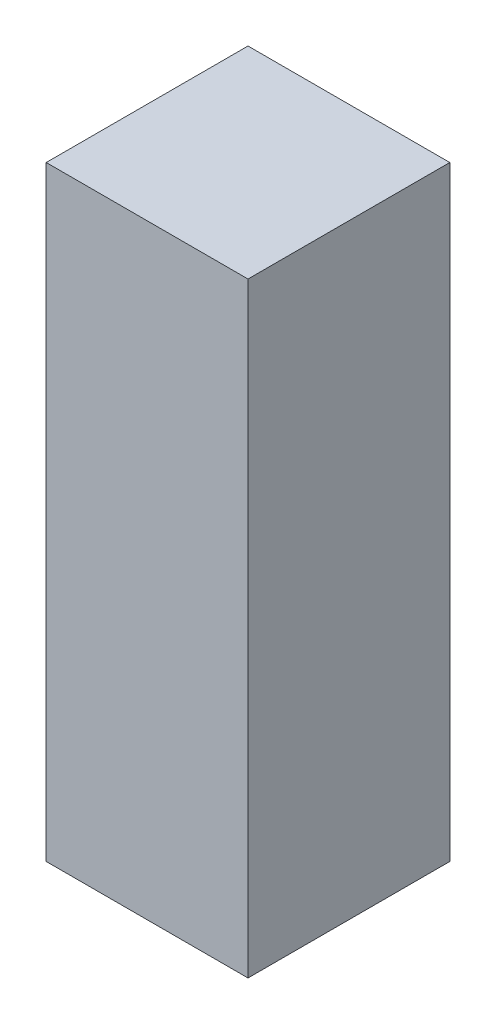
ISO-10303-21;
HEADER;
FILE_DESCRIPTION(('STEP AP214'),'2;1');
FILE_NAME('part.step','',(''),(''),'','','');
FILE_SCHEMA(('AUTOMOTIVE_DESIGN { 1 0 10303 214 1 1 1 1 }'));
ENDSEC;
DATA;
#1=APPLICATION_CONTEXT('core data for automotive mechanical design processes');
#2=APPLICATION_PROTOCOL_DEFINITION('international standard','automotive_design',2000,#1);
#3=PRODUCT_CONTEXT('',#1,'mechanical');
#4=PRODUCT('Part','Part','',(#3));
#5=PRODUCT_RELATED_PRODUCT_CATEGORY('part','',(#4));
#6=PRODUCT_DEFINITION_FORMATION('','',#4);
#7=PRODUCT_DEFINITION_CONTEXT('part definition',#1,'design');
#8=PRODUCT_DEFINITION('design','',#6,#7);
#9=PRODUCT_DEFINITION_SHAPE('','',#8);
#10=(LENGTH_UNIT() NAMED_UNIT(*) SI_UNIT(.MILLI.,.METRE.));
#11=(NAMED_UNIT(*) PLANE_ANGLE_UNIT() SI_UNIT($,.RADIAN.));
#12=(NAMED_UNIT(*) SI_UNIT($,.STERADIAN.) SOLID_ANGLE_UNIT());
#13=UNCERTAINTY_MEASURE_WITH_UNIT(LENGTH_MEASURE(1.E-05),#10,'distance_accuracy_value','');
#14=(GEOMETRIC_REPRESENTATION_CONTEXT(3) GLOBAL_UNCERTAINTY_ASSIGNED_CONTEXT((#13)) GLOBAL_UNIT_ASSIGNED_CONTEXT((#10,
#11,#12)) REPRESENTATION_CONTEXT('',''));
#15=CARTESIAN_POINT('',(0.,0.,0.));
#16=DIRECTION('',(0.,0.,1.));
#17=DIRECTION('',(1.,0.,0.));
#18=AXIS2_PLACEMENT_3D('',#15,#16,#17);
#19=CARTESIAN_POINT('',(0.635000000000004,3.81,0.635000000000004));
#20=DIRECTION('',(-1.,0.,0.));
#21=DIRECTION('',(0.,0.,1.));
#22=AXIS2_PLACEMENT_3D('',#19,#20,#21);
#23=PLANE('',#22);
#24=DIRECTION('',(0.,0.,-1.));
#25=VECTOR('',#24,1.);
#26=CARTESIAN_POINT('',(0.635000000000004,0.,0.635000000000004));
#27=LINE('',#26,#25);
#28=CARTESIAN_POINT('',(0.635000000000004,0.,0.635000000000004));
#29=VERTEX_POINT('',#28);
#30=CARTESIAN_POINT('',(0.635000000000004,0.,-0.634999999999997));
#31=VERTEX_POINT('',#30);
#32=EDGE_CURVE('E96',#29,#31,#27,.T.);
#33=ORIENTED_EDGE('',*,*,#32,.T.);
#34=DIRECTION('',(0.,-1.,0.));
#35=VECTOR('',#34,1.);
#36=CARTESIAN_POINT('',(0.635000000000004,3.81,-0.634999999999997));
#37=LINE('',#36,#35);
#38=CARTESIAN_POINT('',(0.635000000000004,3.81,-0.634999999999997));
#39=VERTEX_POINT('',#38);
#40=EDGE_CURVE('E11',#39,#31,#37,.T.);
#41=ORIENTED_EDGE('',*,*,#40,.F.);
#42=DIRECTION('',(0.,0.,-1.));
#43=VECTOR('',#42,1.);
#44=CARTESIAN_POINT('',(0.635000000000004,3.81,0.635000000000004));
#45=LINE('',#44,#43);
#46=CARTESIAN_POINT('',(0.635000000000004,3.81,0.635000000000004));
#47=VERTEX_POINT('',#46);
#48=EDGE_CURVE('E84',#47,#39,#45,.T.);
#49=ORIENTED_EDGE('',*,*,#48,.F.);
#50=DIRECTION('',(0.,-1.,0.));
#51=VECTOR('',#50,1.);
#52=CARTESIAN_POINT('',(0.635000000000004,3.81,0.635000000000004));
#53=LINE('',#52,#51);
#54=EDGE_CURVE('E92',#47,#29,#53,.T.);
#55=ORIENTED_EDGE('',*,*,#54,.T.);
#56=EDGE_LOOP('',(#33,#41,#49,#55));
#57=FACE_BOUND('',#56,.T.);
#58=ADVANCED_FACE('F33',(#57),#23,.F.);
#59=CARTESIAN_POINT('',(-0.634999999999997,3.81,-0.634999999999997));
#60=DIRECTION('',(0.,0.,1.));
#61=DIRECTION('',(1.,0.,0.));
#62=AXIS2_PLACEMENT_3D('',#59,#60,#61);
#63=PLANE('',#62);
#64=DIRECTION('',(-1.,0.,0.));
#65=VECTOR('',#64,1.);
#66=CARTESIAN_POINT('',(-0.634999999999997,0.,-0.634999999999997));
#67=LINE('',#66,#65);
#68=CARTESIAN_POINT('',(-0.634999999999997,0.,-0.634999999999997));
#69=VERTEX_POINT('',#68);
#70=EDGE_CURVE('E88',#31,#69,#67,.T.);
#71=ORIENTED_EDGE('',*,*,#70,.T.);
#72=DIRECTION('',(0.,-1.,0.));
#73=VECTOR('',#72,1.);
#74=CARTESIAN_POINT('',(-0.634999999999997,3.81,-0.634999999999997));
#75=LINE('',#74,#73);
#76=CARTESIAN_POINT('',(-0.634999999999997,3.81,-0.634999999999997));
#77=VERTEX_POINT('',#76);
#78=EDGE_CURVE('E41',#77,#69,#75,.T.);
#79=ORIENTED_EDGE('',*,*,#78,.F.);
#80=DIRECTION('',(-1.,0.,0.));
#81=VECTOR('',#80,1.);
#82=CARTESIAN_POINT('',(-0.634999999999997,3.81,-0.634999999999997));
#83=LINE('',#82,#81);
#84=EDGE_CURVE('E79',#39,#77,#83,.T.);
#85=ORIENTED_EDGE('',*,*,#84,.F.);
#86=ORIENTED_EDGE('',*,*,#40,.T.);
#87=EDGE_LOOP('',(#71,#79,#85,#86));
#88=FACE_BOUND('',#87,.T.);
#89=ADVANCED_FACE('F87',(#88),#63,.F.);
#90=CARTESIAN_POINT('',(-0.634999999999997,3.81,0.635000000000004));
#91=DIRECTION('',(1.,0.,0.));
#92=DIRECTION('',(0.,0.,-1.));
#93=AXIS2_PLACEMENT_3D('',#90,#91,#92);
#94=PLANE('',#93);
#95=DIRECTION('',(0.,0.,1.));
#96=VECTOR('',#95,1.);
#97=CARTESIAN_POINT('',(-0.634999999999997,0.,0.635000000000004));
#98=LINE('',#97,#96);
#99=CARTESIAN_POINT('',(-0.634999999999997,0.,0.635000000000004));
#100=VERTEX_POINT('',#99);
#101=EDGE_CURVE('E66',#69,#100,#98,.T.);
#102=ORIENTED_EDGE('',*,*,#101,.T.);
#103=DIRECTION('',(0.,-1.,0.));
#104=VECTOR('',#103,1.);
#105=CARTESIAN_POINT('',(-0.634999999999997,3.81,0.635000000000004));
#106=LINE('',#105,#104);
#107=CARTESIAN_POINT('',(-0.634999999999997,3.81,0.635000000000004));
#108=VERTEX_POINT('',#107);
#109=EDGE_CURVE('E89',#108,#100,#106,.T.);
#110=ORIENTED_EDGE('',*,*,#109,.F.);
#111=DIRECTION('',(0.,0.,1.));
#112=VECTOR('',#111,1.);
#113=CARTESIAN_POINT('',(-0.634999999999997,3.81,0.635000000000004));
#114=LINE('',#113,#112);
#115=EDGE_CURVE('E82',#77,#108,#114,.T.);
#116=ORIENTED_EDGE('',*,*,#115,.F.);
#117=ORIENTED_EDGE('',*,*,#78,.T.);
#118=EDGE_LOOP('',(#102,#110,#116,#117));
#119=FACE_BOUND('',#118,.T.);
#120=ADVANCED_FACE('F90',(#119),#94,.F.);
#121=CARTESIAN_POINT('',(-0.634999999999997,3.81,0.635000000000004));
#122=DIRECTION('',(0.,0.,-1.));
#123=DIRECTION('',(-1.,0.,0.));
#124=AXIS2_PLACEMENT_3D('',#121,#122,#123);
#125=PLANE('',#124);
#126=DIRECTION('',(1.,0.,0.));
#127=VECTOR('',#126,1.);
#128=CARTESIAN_POINT('',(-0.634999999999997,0.,0.635000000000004));
#129=LINE('',#128,#127);
#130=EDGE_CURVE('E72',#100,#29,#129,.T.);
#131=ORIENTED_EDGE('',*,*,#130,.T.);
#132=ORIENTED_EDGE('',*,*,#54,.F.);
#133=DIRECTION('',(1.,0.,0.));
#134=VECTOR('',#133,1.);
#135=CARTESIAN_POINT('',(-0.634999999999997,3.81,0.635000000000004));
#136=LINE('',#135,#134);
#137=EDGE_CURVE('E49',#108,#47,#136,.T.);
#138=ORIENTED_EDGE('',*,*,#137,.F.);
#139=ORIENTED_EDGE('',*,*,#109,.T.);
#140=EDGE_LOOP('',(#131,#132,#138,#139));
#141=FACE_BOUND('',#140,.T.);
#142=ADVANCED_FACE('F103',(#141),#125,.F.);
#143=CARTESIAN_POINT('',(0.,3.81,0.));
#144=DIRECTION('',(0.,-1.,0.));
#145=DIRECTION('',(0.,0.,-1.));
#146=AXIS2_PLACEMENT_3D('',#143,#144,#145);
#147=PLANE('',#146);
#148=ORIENTED_EDGE('',*,*,#48,.T.);
#149=ORIENTED_EDGE('',*,*,#84,.T.);
#150=ORIENTED_EDGE('',*,*,#115,.T.);
#151=ORIENTED_EDGE('',*,*,#137,.T.);
#152=EDGE_LOOP('',(#148,#149,#150,#151));
#153=FACE_BOUND('',#152,.T.);
#154=ADVANCED_FACE('F80',(#153),#147,.F.);
#155=CARTESIAN_POINT('',(0.,0.,0.));
#156=DIRECTION('',(0.,-1.,0.));
#157=DIRECTION('',(0.,0.,-1.));
#158=AXIS2_PLACEMENT_3D('',#155,#156,#157);
#159=PLANE('',#158);
#160=ORIENTED_EDGE('',*,*,#32,.F.);
#161=ORIENTED_EDGE('',*,*,#130,.F.);
#162=ORIENTED_EDGE('',*,*,#101,.F.);
#163=ORIENTED_EDGE('',*,*,#70,.F.);
#164=EDGE_LOOP('',(#160,#161,#162,#163));
#165=FACE_BOUND('',#164,.T.);
#166=ADVANCED_FACE('F106',(#165),#159,.T.);
#167=CLOSED_SHELL('',(#58,#89,#120,#142,#154,#166));
#168=MANIFOLD_SOLID_BREP('B2',#167);
#169=ADVANCED_BREP_SHAPE_REPRESENTATION('',(#18,#168),#14);
#170=SHAPE_DEFINITION_REPRESENTATION(#9,#169);
ENDSEC;
END-ISO-10303-21;
